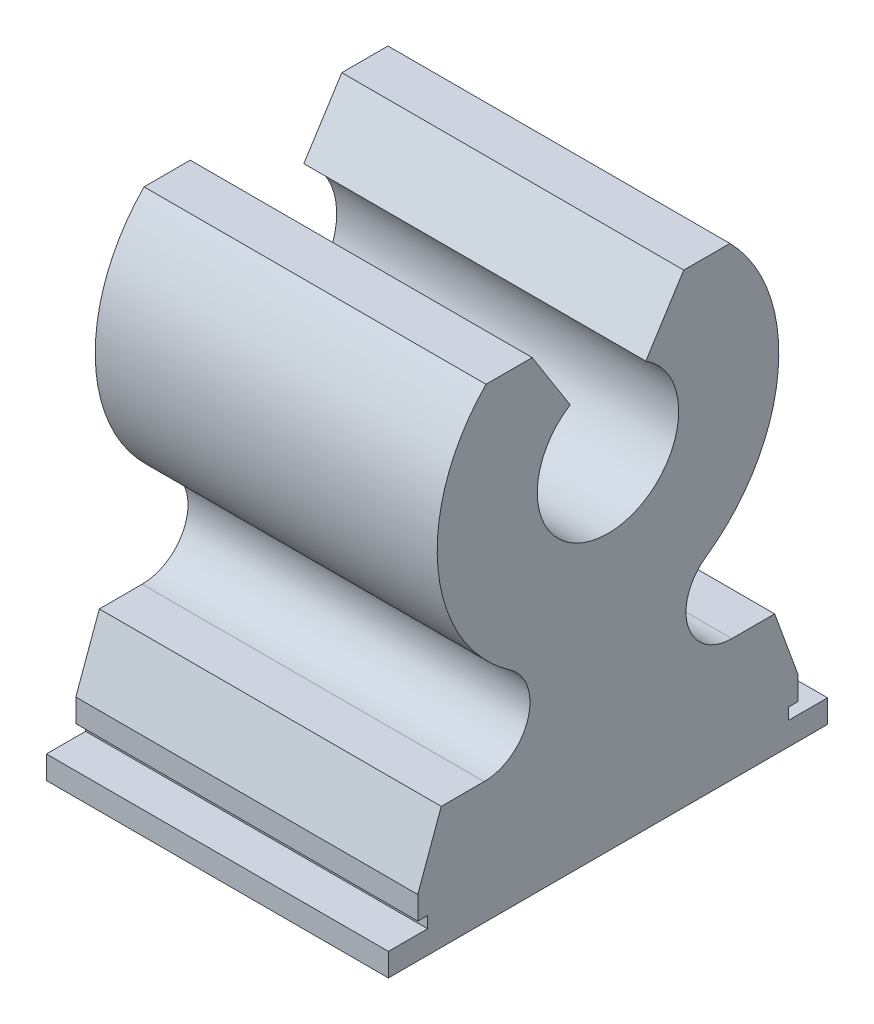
from build123d import *

# Parameters (mm, degrees)
BODY_DEPTH   = 8.9
TOPCUTSKE_W  = 8.89
TOPCUTSKE_H  = 8.89
TOPCUT_DEPTH = 8.9


with BuildPart() as part:
    # BodySke → Body (new body)
    with BuildSketch(Plane(origin=(0, 0, 0), x_dir=(0, 0, -1), z_dir=(1, 0, 0))):
        with BuildLine():
            Line((-5.715, -9), (5.715, -9))
            Line((5.715, -9), (5.715, -8.4))
            Line((5.715, -8.4), (4.695, -8.4))
            Line((4.695, -8.4), (4.695, -8.1))
            Line((4.695, -8.1), (4.95, -8.1))
            Line((4.95, -8.1), (4.95, -7.5))
            Line((4.95, -7.5), (4.338530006, -5.82))
            Line((4.338530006, -5.82), (3.223696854, -5.82))
            ThreePointArc((3.223696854, -5.82), (2.08483996, -4.983958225), (2.54124896, -3.646927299))
            ThreePointArc((2.54124896, -3.646927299), (4.44393925, 0.097102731), (2.379524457, 3.754449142))
            Line((2.379524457, 3.754449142), (0.985, 1.554147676))
            ThreePointArc((0.985, 1.554147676), (0, -1.84), (-0.985, 1.554147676))
            Line((-0.985, 1.554147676), (-2.379524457, 3.754449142))
            ThreePointArc((-2.379524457, 3.754449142), (-4.44393925, 0.097102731), (-2.54124896, -3.646927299))
            ThreePointArc((-2.54124896, -3.646927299), (-2.08483996, -4.983958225), (-3.223696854, -5.82))
            Line((-3.223696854, -5.82), (-4.338530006, -5.82))
            Line((-4.338530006, -5.82), (-4.95, -7.5))
            Line((-4.95, -7.5), (-4.95, -8.1))
            Line((-4.95, -8.1), (-4.695, -8.1))
            Line((-4.695, -8.1), (-4.695, -8.4))
            Line((-4.695, -8.4), (-5.715, -8.4))
            Line((-5.715, -8.4), (-5.715, -9))
        make_face()
    extrude(amount=BODY_DEPTH)

    # TopCutSke → TopCut (cut)
    with BuildSketch(Plane.ZY):
        with Locations((0, 7.5565)):
            Rectangle(TOPCUTSKE_W, TOPCUTSKE_H)
    extrude(amount=-TOPCUT_DEPTH, mode=Mode.SUBTRACT)


solid = part.part
